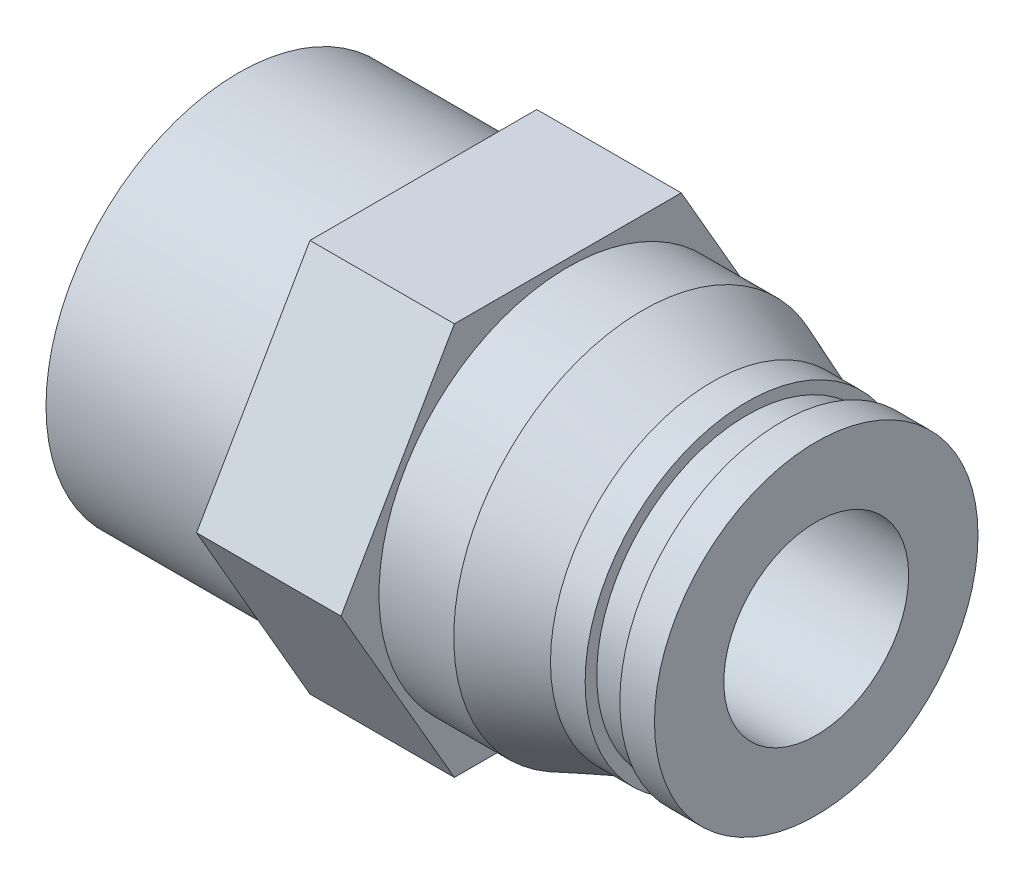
ISO-10303-21;
HEADER;
FILE_DESCRIPTION(('STEP AP214'),'2;1');
FILE_NAME('part.step','',(''),(''),'','','');
FILE_SCHEMA(('AUTOMOTIVE_DESIGN { 1 0 10303 214 1 1 1 1 }'));
ENDSEC;
DATA;
#1=APPLICATION_CONTEXT('core data for automotive mechanical design processes');
#2=APPLICATION_PROTOCOL_DEFINITION('international standard','automotive_design',2000,#1);
#3=PRODUCT_CONTEXT('',#1,'mechanical');
#4=PRODUCT('Part','Part','',(#3));
#5=PRODUCT_RELATED_PRODUCT_CATEGORY('part','',(#4));
#6=PRODUCT_DEFINITION_FORMATION('','',#4);
#7=PRODUCT_DEFINITION_CONTEXT('part definition',#1,'design');
#8=PRODUCT_DEFINITION('design','',#6,#7);
#9=PRODUCT_DEFINITION_SHAPE('','',#8);
#10=(LENGTH_UNIT() NAMED_UNIT(*) SI_UNIT(.MILLI.,.METRE.));
#11=(NAMED_UNIT(*) PLANE_ANGLE_UNIT() SI_UNIT($,.RADIAN.));
#12=(NAMED_UNIT(*) SI_UNIT($,.STERADIAN.) SOLID_ANGLE_UNIT());
#13=UNCERTAINTY_MEASURE_WITH_UNIT(LENGTH_MEASURE(1.E-05),#10,'distance_accuracy_value','');
#14=(GEOMETRIC_REPRESENTATION_CONTEXT(3) GLOBAL_UNCERTAINTY_ASSIGNED_CONTEXT((#13)) GLOBAL_UNIT_ASSIGNED_CONTEXT((#10,
#11,#12)) REPRESENTATION_CONTEXT('',''));
#15=CARTESIAN_POINT('',(0.,0.,0.));
#16=DIRECTION('',(0.,0.,1.));
#17=DIRECTION('',(1.,0.,0.));
#18=AXIS2_PLACEMENT_3D('',#15,#16,#17);
#19=CARTESIAN_POINT('',(8.,8.33,0.));
#20=DIRECTION('',(-1.,0.,0.));
#21=DIRECTION('',(0.,0.,1.));
#22=AXIS2_PLACEMENT_3D('',#19,#20,#21);
#23=PLANE('',#22);
#24=CARTESIAN_POINT('',(8.,0.,0.));
#25=DIRECTION('',(1.,0.,0.));
#26=DIRECTION('',(0.,0.,-1.));
#27=AXIS2_PLACEMENT_3D('',#24,#25,#26);
#28=CIRCLE('',#27,8.33);
#29=CARTESIAN_POINT('',(8.,0.,-8.33));
#30=VERTEX_POINT('',#29);
#31=EDGE_CURVE('E215',#30,#30,#28,.T.);
#32=ORIENTED_EDGE('',*,*,#31,.T.);
#33=EDGE_LOOP('',(#32));
#34=FACE_BOUND('',#33,.T.);
#35=DIRECTION('',(0.,-0.866025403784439,0.5));
#36=VECTOR('',#35,1.);
#37=CARTESIAN_POINT('',(8.,0.,-9.81495457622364));
#38=LINE('',#37,#36);
#39=CARTESIAN_POINT('',(8.,0.,-9.81495457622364));
#40=VERTEX_POINT('',#39);
#41=CARTESIAN_POINT('',(8.,-8.5,-4.90747728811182));
#42=VERTEX_POINT('',#41);
#43=EDGE_CURVE('E121',#40,#42,#38,.T.);
#44=ORIENTED_EDGE('',*,*,#43,.T.);
#45=DIRECTION('',(0.,0.,1.));
#46=VECTOR('',#45,1.);
#47=CARTESIAN_POINT('',(8.,-8.5,-4.90747728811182));
#48=LINE('',#47,#46);
#49=CARTESIAN_POINT('',(8.,-8.5,4.90747728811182));
#50=VERTEX_POINT('',#49);
#51=EDGE_CURVE('E106',#42,#50,#48,.T.);
#52=ORIENTED_EDGE('',*,*,#51,.T.);
#53=DIRECTION('',(0.,0.866025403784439,0.5));
#54=VECTOR('',#53,1.);
#55=CARTESIAN_POINT('',(8.,-8.5,4.90747728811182));
#56=LINE('',#55,#54);
#57=CARTESIAN_POINT('',(8.,0.,9.81495457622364));
#58=VERTEX_POINT('',#57);
#59=EDGE_CURVE('E115',#50,#58,#56,.T.);
#60=ORIENTED_EDGE('',*,*,#59,.T.);
#61=DIRECTION('',(0.,0.866025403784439,-0.5));
#62=VECTOR('',#61,1.);
#63=CARTESIAN_POINT('',(8.,0.,9.81495457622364));
#64=LINE('',#63,#62);
#65=CARTESIAN_POINT('',(8.,8.5,4.90747728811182));
#66=VERTEX_POINT('',#65);
#67=EDGE_CURVE('E30',#58,#66,#64,.T.);
#68=ORIENTED_EDGE('',*,*,#67,.T.);
#69=DIRECTION('',(0.,0.,-1.));
#70=VECTOR('',#69,1.);
#71=CARTESIAN_POINT('',(8.,8.5,4.90747728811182));
#72=LINE('',#71,#70);
#73=CARTESIAN_POINT('',(8.,8.5,-4.90747728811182));
#74=VERTEX_POINT('',#73);
#75=EDGE_CURVE('E125',#66,#74,#72,.T.);
#76=ORIENTED_EDGE('',*,*,#75,.T.);
#77=DIRECTION('',(0.,-0.866025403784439,-0.5));
#78=VECTOR('',#77,1.);
#79=CARTESIAN_POINT('',(8.,8.5,-4.90747728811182));
#80=LINE('',#79,#78);
#81=EDGE_CURVE('E128',#74,#40,#80,.T.);
#82=ORIENTED_EDGE('',*,*,#81,.T.);
#83=EDGE_LOOP('',(#44,#52,#60,#68,#76,#82));
#84=FACE_BOUND('',#83,.T.);
#85=ADVANCED_FACE('F15',(#34,#84),#23,.T.);
#86=CARTESIAN_POINT('',(14.25,10.5,0.));
#87=DIRECTION('',(1.,0.,0.));
#88=DIRECTION('',(0.,0.,-1.));
#89=AXIS2_PLACEMENT_3D('',#86,#87,#88);
#90=PLANE('',#89);
#91=CARTESIAN_POINT('',(14.25,0.,0.));
#92=DIRECTION('',(1.,0.,0.));
#93=DIRECTION('',(0.,0.,-1.));
#94=AXIS2_PLACEMENT_3D('',#91,#92,#93);
#95=CIRCLE('',#94,8.17125407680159);
#96=CARTESIAN_POINT('',(14.25,0.,-8.17125407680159));
#97=VERTEX_POINT('',#96);
#98=EDGE_CURVE('E212',#97,#97,#95,.T.);
#99=ORIENTED_EDGE('',*,*,#98,.F.);
#100=EDGE_LOOP('',(#99));
#101=FACE_BOUND('',#100,.T.);
#102=DIRECTION('',(0.,0.866025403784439,0.5));
#103=VECTOR('',#102,1.);
#104=CARTESIAN_POINT('',(14.25,-8.5,4.90747728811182));
#105=LINE('',#104,#103);
#106=CARTESIAN_POINT('',(14.25,-8.5,4.90747728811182));
#107=VERTEX_POINT('',#106);
#108=CARTESIAN_POINT('',(14.25,0.,9.81495457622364));
#109=VERTEX_POINT('',#108);
#110=EDGE_CURVE('E132',#107,#109,#105,.T.);
#111=ORIENTED_EDGE('',*,*,#110,.F.);
#112=DIRECTION('',(0.,0.,1.));
#113=VECTOR('',#112,1.);
#114=CARTESIAN_POINT('',(14.25,-8.5,-4.90747728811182));
#115=LINE('',#114,#113);
#116=CARTESIAN_POINT('',(14.25,-8.5,-4.90747728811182));
#117=VERTEX_POINT('',#116);
#118=EDGE_CURVE('E38',#117,#107,#115,.T.);
#119=ORIENTED_EDGE('',*,*,#118,.F.);
#120=DIRECTION('',(0.,-0.866025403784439,0.5));
#121=VECTOR('',#120,1.);
#122=CARTESIAN_POINT('',(14.25,0.,-9.81495457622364));
#123=LINE('',#122,#121);
#124=CARTESIAN_POINT('',(14.25,0.,-9.81495457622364));
#125=VERTEX_POINT('',#124);
#126=EDGE_CURVE('E112',#125,#117,#123,.T.);
#127=ORIENTED_EDGE('',*,*,#126,.F.);
#128=DIRECTION('',(0.,-0.866025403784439,-0.5));
#129=VECTOR('',#128,1.);
#130=CARTESIAN_POINT('',(14.25,8.5,-4.90747728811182));
#131=LINE('',#130,#129);
#132=CARTESIAN_POINT('',(14.25,8.5,-4.90747728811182));
#133=VERTEX_POINT('',#132);
#134=EDGE_CURVE('E140',#133,#125,#131,.T.);
#135=ORIENTED_EDGE('',*,*,#134,.F.);
#136=DIRECTION('',(0.,0.,-1.));
#137=VECTOR('',#136,1.);
#138=CARTESIAN_POINT('',(14.25,8.5,4.90747728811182));
#139=LINE('',#138,#137);
#140=CARTESIAN_POINT('',(14.25,8.5,4.90747728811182));
#141=VERTEX_POINT('',#140);
#142=EDGE_CURVE('E137',#141,#133,#139,.T.);
#143=ORIENTED_EDGE('',*,*,#142,.F.);
#144=DIRECTION('',(0.,0.866025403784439,-0.5));
#145=VECTOR('',#144,1.);
#146=CARTESIAN_POINT('',(14.25,0.,9.81495457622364));
#147=LINE('',#146,#145);
#148=EDGE_CURVE('E134',#109,#141,#147,.T.);
#149=ORIENTED_EDGE('',*,*,#148,.F.);
#150=EDGE_LOOP('',(#111,#119,#127,#135,#143,#149));
#151=FACE_BOUND('',#150,.T.);
#152=ADVANCED_FACE('F269',(#101,#151),#90,.T.);
#153=CARTESIAN_POINT('',(0.,0.,0.));
#154=DIRECTION('',(-1.,0.,0.));
#155=DIRECTION('',(0.,0.,1.));
#156=AXIS2_PLACEMENT_3D('',#153,#154,#155);
#157=PLANE('',#156);
#158=CARTESIAN_POINT('',(0.,0.,0.));
#159=DIRECTION('',(1.,0.,0.));
#160=DIRECTION('',(0.,0.,-1.));
#161=AXIS2_PLACEMENT_3D('',#158,#159,#160);
#162=CIRCLE('',#161,8.33);
#163=CARTESIAN_POINT('',(0.,0.,-8.33));
#164=VERTEX_POINT('',#163);
#165=EDGE_CURVE('E218',#164,#164,#162,.T.);
#166=ORIENTED_EDGE('',*,*,#165,.F.);
#167=EDGE_LOOP('',(#166));
#168=FACE_BOUND('',#167,.T.);
#169=DIRECTION('',(0.,-0.866025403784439,-0.5));
#170=VECTOR('',#169,1.);
#171=CARTESIAN_POINT('',(0.,0.,3.46410161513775));
#172=LINE('',#171,#170);
#173=CARTESIAN_POINT('',(0.,0.,3.46410161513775));
#174=VERTEX_POINT('',#173);
#175=CARTESIAN_POINT('',(0.,-3.,1.73205080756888));
#176=VERTEX_POINT('',#175);
#177=EDGE_CURVE('E169',#174,#176,#172,.T.);
#178=ORIENTED_EDGE('',*,*,#177,.T.);
#179=DIRECTION('',(0.,0.,-1.));
#180=VECTOR('',#179,1.);
#181=CARTESIAN_POINT('',(0.,-3.,1.73205080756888));
#182=LINE('',#181,#180);
#183=CARTESIAN_POINT('',(0.,-3.,-1.73205080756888));
#184=VERTEX_POINT('',#183);
#185=EDGE_CURVE('E147',#176,#184,#182,.T.);
#186=ORIENTED_EDGE('',*,*,#185,.T.);
#187=DIRECTION('',(0.,0.866025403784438,-0.5));
#188=VECTOR('',#187,1.);
#189=CARTESIAN_POINT('',(0.,-3.,-1.73205080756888));
#190=LINE('',#189,#188);
#191=CARTESIAN_POINT('',(0.,0.,-3.46410161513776));
#192=VERTEX_POINT('',#191);
#193=EDGE_CURVE('E157',#184,#192,#190,.T.);
#194=ORIENTED_EDGE('',*,*,#193,.T.);
#195=DIRECTION('',(0.,0.866025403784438,0.5));
#196=VECTOR('',#195,1.);
#197=CARTESIAN_POINT('',(0.,0.,-3.46410161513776));
#198=LINE('',#197,#196);
#199=CARTESIAN_POINT('',(0.,3.,-1.73205080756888));
#200=VERTEX_POINT('',#199);
#201=EDGE_CURVE('E160',#192,#200,#198,.T.);
#202=ORIENTED_EDGE('',*,*,#201,.T.);
#203=DIRECTION('',(0.,0.,1.));
#204=VECTOR('',#203,1.);
#205=CARTESIAN_POINT('',(0.,3.,-1.73205080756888));
#206=LINE('',#205,#204);
#207=CARTESIAN_POINT('',(0.,3.,1.73205080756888));
#208=VERTEX_POINT('',#207);
#209=EDGE_CURVE('E163',#200,#208,#206,.T.);
#210=ORIENTED_EDGE('',*,*,#209,.T.);
#211=DIRECTION('',(0.,-0.866025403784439,0.5));
#212=VECTOR('',#211,1.);
#213=CARTESIAN_POINT('',(0.,3.,1.73205080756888));
#214=LINE('',#213,#212);
#215=EDGE_CURVE('E166',#208,#174,#214,.T.);
#216=ORIENTED_EDGE('',*,*,#215,.T.);
#217=EDGE_LOOP('',(#178,#186,#194,#202,#210,#216));
#218=FACE_BOUND('',#217,.T.);
#219=ADVANCED_FACE('F17',(#168,#218),#157,.T.);
#220=CARTESIAN_POINT('',(7.5,4.,0.));
#221=DIRECTION('',(1.,0.,0.));
#222=DIRECTION('',(0.,0.,-1.));
#223=AXIS2_PLACEMENT_3D('',#220,#221,#222);
#224=PLANE('',#223);
#225=CARTESIAN_POINT('',(7.5,0.,0.));
#226=DIRECTION('',(1.,0.,0.));
#227=DIRECTION('',(0.,0.,-1.));
#228=AXIS2_PLACEMENT_3D('',#225,#226,#227);
#229=CIRCLE('',#228,4.);
#230=CARTESIAN_POINT('',(7.5,0.,-4.));
#231=VERTEX_POINT('',#230);
#232=EDGE_CURVE('E185',#231,#231,#229,.T.);
#233=ORIENTED_EDGE('',*,*,#232,.T.);
#234=EDGE_LOOP('',(#233));
#235=FACE_BOUND('',#234,.T.);
#236=DIRECTION('',(0.,-0.866025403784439,0.5));
#237=VECTOR('',#236,1.);
#238=CARTESIAN_POINT('',(7.5,1.5,-4.3301270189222));
#239=LINE('',#238,#237);
#240=CARTESIAN_POINT('',(7.5,0.,-3.46410161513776));
#241=VERTEX_POINT('',#240);
#242=CARTESIAN_POINT('',(7.5,-3.,-1.73205080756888));
#243=VERTEX_POINT('',#242);
#244=EDGE_CURVE('E23',#241,#243,#239,.T.);
#245=ORIENTED_EDGE('',*,*,#244,.T.);
#246=DIRECTION('',(0.,0.,1.));
#247=VECTOR('',#246,1.);
#248=CARTESIAN_POINT('',(7.5,-3.,0.));
#249=LINE('',#248,#247);
#250=CARTESIAN_POINT('',(7.5,-3.,1.73205080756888));
#251=VERTEX_POINT('',#250);
#252=EDGE_CURVE('E9',#243,#251,#249,.T.);
#253=ORIENTED_EDGE('',*,*,#252,.T.);
#254=DIRECTION('',(0.,0.866025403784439,0.5));
#255=VECTOR('',#254,1.);
#256=CARTESIAN_POINT('',(7.5,1.5,4.33012701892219));
#257=LINE('',#256,#255);
#258=CARTESIAN_POINT('',(7.5,0.,3.46410161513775));
#259=VERTEX_POINT('',#258);
#260=EDGE_CURVE('E221',#251,#259,#257,.T.);
#261=ORIENTED_EDGE('',*,*,#260,.T.);
#262=DIRECTION('',(0.,0.866025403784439,-0.5));
#263=VECTOR('',#262,1.);
#264=CARTESIAN_POINT('',(7.5,4.5,0.866025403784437));
#265=LINE('',#264,#263);
#266=CARTESIAN_POINT('',(7.5,3.,1.73205080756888));
#267=VERTEX_POINT('',#266);
#268=EDGE_CURVE('E224',#259,#267,#265,.T.);
#269=ORIENTED_EDGE('',*,*,#268,.T.);
#270=DIRECTION('',(0.,0.,-1.));
#271=VECTOR('',#270,1.);
#272=CARTESIAN_POINT('',(7.5,3.,0.));
#273=LINE('',#272,#271);
#274=CARTESIAN_POINT('',(7.5,3.,-1.73205080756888));
#275=VERTEX_POINT('',#274);
#276=EDGE_CURVE('E227',#267,#275,#273,.T.);
#277=ORIENTED_EDGE('',*,*,#276,.T.);
#278=DIRECTION('',(0.,-0.866025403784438,-0.5));
#279=VECTOR('',#278,1.);
#280=CARTESIAN_POINT('',(7.5,4.5,-0.866025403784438));
#281=LINE('',#280,#279);
#282=EDGE_CURVE('E230',#275,#241,#281,.T.);
#283=ORIENTED_EDGE('',*,*,#282,.T.);
#284=EDGE_LOOP('',(#245,#253,#261,#269,#277,#283));
#285=FACE_BOUND('',#284,.T.);
#286=ADVANCED_FACE('F234',(#235,#285),#224,.T.);
#287=CARTESIAN_POINT('',(0.,0.,0.));
#288=DIRECTION('',(1.,0.,0.));
#289=DIRECTION('',(0.,0.,-1.));
#290=AXIS2_PLACEMENT_3D('',#287,#288,#289);
#291=CYLINDRICAL_SURFACE('',#290,8.33);
#292=ORIENTED_EDGE('',*,*,#165,.T.);
#293=EDGE_LOOP('',(#292));
#294=FACE_BOUND('',#293,.T.);
#295=ORIENTED_EDGE('',*,*,#31,.F.);
#296=EDGE_LOOP('',(#295));
#297=FACE_BOUND('',#296,.T.);
#298=ADVANCED_FACE('F278',(#294,#297),#291,.T.);
#299=CARTESIAN_POINT('',(0.,0.,0.));
#300=DIRECTION('',(1.,0.,0.));
#301=DIRECTION('',(0.,0.,-1.));
#302=AXIS2_PLACEMENT_3D('',#299,#300,#301);
#303=CYLINDRICAL_SURFACE('',#302,8.17125407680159);
#304=ORIENTED_EDGE('',*,*,#98,.T.);
#305=EDGE_LOOP('',(#304));
#306=FACE_BOUND('',#305,.T.);
#307=CARTESIAN_POINT('',(17.4847468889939,0.,0.));
#308=DIRECTION('',(1.,0.,0.));
#309=DIRECTION('',(0.,0.,-1.));
#310=AXIS2_PLACEMENT_3D('',#307,#308,#309);
#311=CIRCLE('',#310,8.17125407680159);
#312=CARTESIAN_POINT('',(17.4847468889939,0.,-8.17125407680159));
#313=VERTEX_POINT('',#312);
#314=EDGE_CURVE('E209',#313,#313,#311,.T.);
#315=ORIENTED_EDGE('',*,*,#314,.F.);
#316=EDGE_LOOP('',(#315));
#317=FACE_BOUND('',#316,.T.);
#318=ADVANCED_FACE('F280',(#306,#317),#303,.T.);
#319=CARTESIAN_POINT('',(20.5,0.,0.));
#320=DIRECTION('',(-1.,0.,0.));
#321=DIRECTION('',(0.,0.,1.));
#322=AXIS2_PLACEMENT_3D('',#319,#320,#321);
#323=CONICAL_SURFACE('',#322,7.,0.370503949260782);
#324=ORIENTED_EDGE('',*,*,#314,.T.);
#325=EDGE_LOOP('',(#324));
#326=FACE_BOUND('',#325,.T.);
#327=CARTESIAN_POINT('',(20.5,0.,0.));
#328=DIRECTION('',(1.,0.,0.));
#329=DIRECTION('',(0.,0.,-1.));
#330=AXIS2_PLACEMENT_3D('',#327,#328,#329);
#331=CIRCLE('',#330,7.);
#332=CARTESIAN_POINT('',(20.5,0.,-7.));
#333=VERTEX_POINT('',#332);
#334=EDGE_CURVE('E206',#333,#333,#331,.T.);
#335=ORIENTED_EDGE('',*,*,#334,.F.);
#336=EDGE_LOOP('',(#335));
#337=FACE_BOUND('',#336,.T.);
#338=ADVANCED_FACE('F286',(#326,#337),#323,.T.);
#339=CARTESIAN_POINT('',(0.,0.,0.));
#340=DIRECTION('',(1.,0.,0.));
#341=DIRECTION('',(0.,0.,-1.));
#342=AXIS2_PLACEMENT_3D('',#339,#340,#341);
#343=CYLINDRICAL_SURFACE('',#342,7.);
#344=ORIENTED_EDGE('',*,*,#334,.T.);
#345=EDGE_LOOP('',(#344));
#346=FACE_BOUND('',#345,.T.);
#347=CARTESIAN_POINT('',(22.,0.,0.));
#348=DIRECTION('',(1.,0.,0.));
#349=DIRECTION('',(0.,0.,-1.));
#350=AXIS2_PLACEMENT_3D('',#347,#348,#349);
#351=CIRCLE('',#350,7.);
#352=CARTESIAN_POINT('',(22.,0.,-7.));
#353=VERTEX_POINT('',#352);
#354=EDGE_CURVE('E203',#353,#353,#351,.T.);
#355=ORIENTED_EDGE('',*,*,#354,.F.);
#356=EDGE_LOOP('',(#355));
#357=FACE_BOUND('',#356,.T.);
#358=ADVANCED_FACE('F330',(#346,#357),#343,.T.);
#359=CARTESIAN_POINT('',(22.,7.,0.));
#360=DIRECTION('',(1.,0.,0.));
#361=DIRECTION('',(0.,0.,-1.));
#362=AXIS2_PLACEMENT_3D('',#359,#360,#361);
#363=PLANE('',#362);
#364=ORIENTED_EDGE('',*,*,#354,.T.);
#365=EDGE_LOOP('',(#364));
#366=FACE_BOUND('',#365,.T.);
#367=CARTESIAN_POINT('',(22.,0.,0.));
#368=DIRECTION('',(1.,0.,0.));
#369=DIRECTION('',(0.,0.,-1.));
#370=AXIS2_PLACEMENT_3D('',#367,#368,#369);
#371=CIRCLE('',#370,6.5);
#372=CARTESIAN_POINT('',(22.,0.,-6.5));
#373=VERTEX_POINT('',#372);
#374=EDGE_CURVE('E200',#373,#373,#371,.T.);
#375=ORIENTED_EDGE('',*,*,#374,.F.);
#376=EDGE_LOOP('',(#375));
#377=FACE_BOUND('',#376,.T.);
#378=ADVANCED_FACE('F340',(#366,#377),#363,.T.);
#379=CARTESIAN_POINT('',(0.,0.,0.));
#380=DIRECTION('',(1.,0.,0.));
#381=DIRECTION('',(0.,0.,-1.));
#382=AXIS2_PLACEMENT_3D('',#379,#380,#381);
#383=CYLINDRICAL_SURFACE('',#382,6.5);
#384=ORIENTED_EDGE('',*,*,#374,.T.);
#385=EDGE_LOOP('',(#384));
#386=FACE_BOUND('',#385,.T.);
#387=CARTESIAN_POINT('',(23.5,0.,0.));
#388=DIRECTION('',(1.,0.,0.));
#389=DIRECTION('',(0.,0.,-1.));
#390=AXIS2_PLACEMENT_3D('',#387,#388,#389);
#391=CIRCLE('',#390,6.5);
#392=CARTESIAN_POINT('',(23.5,0.,-6.5));
#393=VERTEX_POINT('',#392);
#394=EDGE_CURVE('E197',#393,#393,#391,.T.);
#395=ORIENTED_EDGE('',*,*,#394,.F.);
#396=EDGE_LOOP('',(#395));
#397=FACE_BOUND('',#396,.T.);
#398=ADVANCED_FACE('F350',(#386,#397),#383,.T.);
#399=CARTESIAN_POINT('',(23.5,6.5,0.));
#400=DIRECTION('',(-1.,0.,0.));
#401=DIRECTION('',(0.,0.,1.));
#402=AXIS2_PLACEMENT_3D('',#399,#400,#401);
#403=PLANE('',#402);
#404=ORIENTED_EDGE('',*,*,#394,.T.);
#405=EDGE_LOOP('',(#404));
#406=FACE_BOUND('',#405,.T.);
#407=CARTESIAN_POINT('',(23.5,0.,0.));
#408=DIRECTION('',(1.,0.,0.));
#409=DIRECTION('',(0.,0.,-1.));
#410=AXIS2_PLACEMENT_3D('',#407,#408,#409);
#411=CIRCLE('',#410,7.);
#412=CARTESIAN_POINT('',(23.5,0.,-7.));
#413=VERTEX_POINT('',#412);
#414=EDGE_CURVE('E194',#413,#413,#411,.T.);
#415=ORIENTED_EDGE('',*,*,#414,.F.);
#416=EDGE_LOOP('',(#415));
#417=FACE_BOUND('',#416,.T.);
#418=ADVANCED_FACE('F361',(#406,#417),#403,.T.);
#419=CARTESIAN_POINT('',(0.,0.,0.));
#420=DIRECTION('',(1.,0.,0.));
#421=DIRECTION('',(0.,0.,-1.));
#422=AXIS2_PLACEMENT_3D('',#419,#420,#421);
#423=CYLINDRICAL_SURFACE('',#422,7.);
#424=ORIENTED_EDGE('',*,*,#414,.T.);
#425=EDGE_LOOP('',(#424));
#426=FACE_BOUND('',#425,.T.);
#427=CARTESIAN_POINT('',(25.,0.,0.));
#428=DIRECTION('',(1.,0.,0.));
#429=DIRECTION('',(0.,0.,-1.));
#430=AXIS2_PLACEMENT_3D('',#427,#428,#429);
#431=CIRCLE('',#430,7.);
#432=CARTESIAN_POINT('',(25.,0.,-7.));
#433=VERTEX_POINT('',#432);
#434=EDGE_CURVE('E191',#433,#433,#431,.T.);
#435=ORIENTED_EDGE('',*,*,#434,.F.);
#436=EDGE_LOOP('',(#435));
#437=FACE_BOUND('',#436,.T.);
#438=ADVANCED_FACE('F375',(#426,#437),#423,.T.);
#439=CARTESIAN_POINT('',(25.,7.,0.));
#440=DIRECTION('',(1.,0.,0.));
#441=DIRECTION('',(0.,0.,-1.));
#442=AXIS2_PLACEMENT_3D('',#439,#440,#441);
#443=PLANE('',#442);
#444=ORIENTED_EDGE('',*,*,#434,.T.);
#445=EDGE_LOOP('',(#444));
#446=FACE_BOUND('',#445,.T.);
#447=CARTESIAN_POINT('',(25.,0.,0.));
#448=DIRECTION('',(1.,0.,0.));
#449=DIRECTION('',(0.,0.,-1.));
#450=AXIS2_PLACEMENT_3D('',#447,#448,#449);
#451=CIRCLE('',#450,4.);
#452=CARTESIAN_POINT('',(25.,0.,-4.));
#453=VERTEX_POINT('',#452);
#454=EDGE_CURVE('E188',#453,#453,#451,.T.);
#455=ORIENTED_EDGE('',*,*,#454,.F.);
#456=EDGE_LOOP('',(#455));
#457=FACE_BOUND('',#456,.T.);
#458=ADVANCED_FACE('F385',(#446,#457),#443,.T.);
#459=CARTESIAN_POINT('',(0.,0.,0.));
#460=DIRECTION('',(1.,0.,0.));
#461=DIRECTION('',(0.,0.,-1.));
#462=AXIS2_PLACEMENT_3D('',#459,#460,#461);
#463=CYLINDRICAL_SURFACE('',#462,4.);
#464=ORIENTED_EDGE('',*,*,#454,.T.);
#465=EDGE_LOOP('',(#464));
#466=FACE_BOUND('',#465,.T.);
#467=ORIENTED_EDGE('',*,*,#232,.F.);
#468=EDGE_LOOP('',(#467));
#469=FACE_BOUND('',#468,.T.);
#470=ADVANCED_FACE('F396',(#466,#469),#463,.F.);
#471=CARTESIAN_POINT('',(25.,-3.,1.73205080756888));
#472=DIRECTION('',(0.,1.,0.));
#473=DIRECTION('',(0.,0.,1.));
#474=AXIS2_PLACEMENT_3D('',#471,#472,#473);
#475=PLANE('',#474);
#476=DIRECTION('',(-1.,0.,0.));
#477=VECTOR('',#476,1.);
#478=CARTESIAN_POINT('',(25.,-3.,-1.73205080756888));
#479=LINE('',#478,#477);
#480=EDGE_CURVE('E183',#243,#184,#479,.T.);
#481=ORIENTED_EDGE('',*,*,#480,.T.);
#482=ORIENTED_EDGE('',*,*,#185,.F.);
#483=DIRECTION('',(-1.,0.,0.));
#484=VECTOR('',#483,1.);
#485=CARTESIAN_POINT('',(25.,-3.,1.73205080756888));
#486=LINE('',#485,#484);
#487=EDGE_CURVE('E172',#251,#176,#486,.T.);
#488=ORIENTED_EDGE('',*,*,#487,.F.);
#489=ORIENTED_EDGE('',*,*,#252,.F.);
#490=EDGE_LOOP('',(#481,#482,#488,#489));
#491=FACE_BOUND('',#490,.T.);
#492=ADVANCED_FACE('F249',(#491),#475,.T.);
#493=CARTESIAN_POINT('',(25.,-3.,-1.73205080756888));
#494=DIRECTION('',(0.,0.5,0.866025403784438));
#495=DIRECTION('',(0.,-0.866025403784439,0.5));
#496=AXIS2_PLACEMENT_3D('',#493,#494,#495);
#497=PLANE('',#496);
#498=DIRECTION('',(-1.,0.,0.));
#499=VECTOR('',#498,1.);
#500=CARTESIAN_POINT('',(25.,0.,-3.46410161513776));
#501=LINE('',#500,#499);
#502=EDGE_CURVE('E181',#241,#192,#501,.T.);
#503=ORIENTED_EDGE('',*,*,#502,.T.);
#504=ORIENTED_EDGE('',*,*,#193,.F.);
#505=ORIENTED_EDGE('',*,*,#480,.F.);
#506=ORIENTED_EDGE('',*,*,#244,.F.);
#507=EDGE_LOOP('',(#503,#504,#505,#506));
#508=FACE_BOUND('',#507,.T.);
#509=ADVANCED_FACE('F238',(#508),#497,.T.);
#510=CARTESIAN_POINT('',(25.,0.,-3.46410161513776));
#511=DIRECTION('',(0.,-0.5,0.866025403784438));
#512=DIRECTION('',(0.,-0.866025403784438,-0.5));
#513=AXIS2_PLACEMENT_3D('',#510,#511,#512);
#514=PLANE('',#513);
#515=DIRECTION('',(-1.,0.,0.));
#516=VECTOR('',#515,1.);
#517=CARTESIAN_POINT('',(25.,3.,-1.73205080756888));
#518=LINE('',#517,#516);
#519=EDGE_CURVE('E179',#275,#200,#518,.T.);
#520=ORIENTED_EDGE('',*,*,#519,.T.);
#521=ORIENTED_EDGE('',*,*,#201,.F.);
#522=ORIENTED_EDGE('',*,*,#502,.F.);
#523=ORIENTED_EDGE('',*,*,#282,.F.);
#524=EDGE_LOOP('',(#520,#521,#522,#523));
#525=FACE_BOUND('',#524,.T.);
#526=ADVANCED_FACE('F242',(#525),#514,.T.);
#527=CARTESIAN_POINT('',(25.,3.,-1.73205080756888));
#528=DIRECTION('',(0.,-1.,0.));
#529=DIRECTION('',(0.,0.,-1.));
#530=AXIS2_PLACEMENT_3D('',#527,#528,#529);
#531=PLANE('',#530);
#532=DIRECTION('',(-1.,0.,0.));
#533=VECTOR('',#532,1.);
#534=CARTESIAN_POINT('',(25.,3.,1.73205080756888));
#535=LINE('',#534,#533);
#536=EDGE_CURVE('E177',#267,#208,#535,.T.);
#537=ORIENTED_EDGE('',*,*,#536,.T.);
#538=ORIENTED_EDGE('',*,*,#209,.F.);
#539=ORIENTED_EDGE('',*,*,#519,.F.);
#540=ORIENTED_EDGE('',*,*,#276,.F.);
#541=EDGE_LOOP('',(#537,#538,#539,#540));
#542=FACE_BOUND('',#541,.T.);
#543=ADVANCED_FACE('F258',(#542),#531,.T.);
#544=CARTESIAN_POINT('',(25.,3.,1.73205080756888));
#545=DIRECTION('',(0.,-0.5,-0.866025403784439));
#546=DIRECTION('',(0.,0.866025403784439,-0.5));
#547=AXIS2_PLACEMENT_3D('',#544,#545,#546);
#548=PLANE('',#547);
#549=DIRECTION('',(-1.,0.,0.));
#550=VECTOR('',#549,1.);
#551=CARTESIAN_POINT('',(25.,0.,3.46410161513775));
#552=LINE('',#551,#550);
#553=EDGE_CURVE('E175',#259,#174,#552,.T.);
#554=ORIENTED_EDGE('',*,*,#553,.T.);
#555=ORIENTED_EDGE('',*,*,#215,.F.);
#556=ORIENTED_EDGE('',*,*,#536,.F.);
#557=ORIENTED_EDGE('',*,*,#268,.F.);
#558=EDGE_LOOP('',(#554,#555,#556,#557));
#559=FACE_BOUND('',#558,.T.);
#560=ADVANCED_FACE('F255',(#559),#548,.T.);
#561=CARTESIAN_POINT('',(25.,0.,3.46410161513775));
#562=DIRECTION('',(0.,0.5,-0.866025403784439));
#563=DIRECTION('',(0.,0.866025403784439,0.5));
#564=AXIS2_PLACEMENT_3D('',#561,#562,#563);
#565=PLANE('',#564);
#566=ORIENTED_EDGE('',*,*,#487,.T.);
#567=ORIENTED_EDGE('',*,*,#177,.F.);
#568=ORIENTED_EDGE('',*,*,#553,.F.);
#569=ORIENTED_EDGE('',*,*,#260,.F.);
#570=EDGE_LOOP('',(#566,#567,#568,#569));
#571=FACE_BOUND('',#570,.T.);
#572=ADVANCED_FACE('F251',(#571),#565,.T.);
#573=CARTESIAN_POINT('',(14.25,-8.5,-4.90747728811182));
#574=DIRECTION('',(0.,-1.,0.));
#575=DIRECTION('',(0.,0.,-1.));
#576=AXIS2_PLACEMENT_3D('',#573,#574,#575);
#577=PLANE('',#576);
#578=DIRECTION('',(-1.,0.,0.));
#579=VECTOR('',#578,1.);
#580=CARTESIAN_POINT('',(14.25,-8.5,-4.90747728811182));
#581=LINE('',#580,#579);
#582=EDGE_CURVE('E145',#117,#42,#581,.T.);
#583=ORIENTED_EDGE('',*,*,#582,.F.);
#584=ORIENTED_EDGE('',*,*,#118,.T.);
#585=DIRECTION('',(-1.,0.,0.));
#586=VECTOR('',#585,1.);
#587=CARTESIAN_POINT('',(14.25,-8.5,4.90747728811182));
#588=LINE('',#587,#586);
#589=EDGE_CURVE('E102',#107,#50,#588,.T.);
#590=ORIENTED_EDGE('',*,*,#589,.T.);
#591=ORIENTED_EDGE('',*,*,#51,.F.);
#592=EDGE_LOOP('',(#583,#584,#590,#591));
#593=FACE_BOUND('',#592,.T.);
#594=ADVANCED_FACE('F104',(#593),#577,.T.);
#595=CARTESIAN_POINT('',(14.25,0.,-9.81495457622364));
#596=DIRECTION('',(0.,-0.5,-0.866025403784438));
#597=DIRECTION('',(0.,0.866025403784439,-0.5));
#598=AXIS2_PLACEMENT_3D('',#595,#596,#597);
#599=PLANE('',#598);
#600=DIRECTION('',(-1.,0.,0.));
#601=VECTOR('',#600,1.);
#602=CARTESIAN_POINT('',(14.25,0.,-9.81495457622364));
#603=LINE('',#602,#601);
#604=EDGE_CURVE('E148',#125,#40,#603,.T.);
#605=ORIENTED_EDGE('',*,*,#604,.F.);
#606=ORIENTED_EDGE('',*,*,#126,.T.);
#607=ORIENTED_EDGE('',*,*,#582,.T.);
#608=ORIENTED_EDGE('',*,*,#43,.F.);
#609=EDGE_LOOP('',(#605,#606,#607,#608));
#610=FACE_BOUND('',#609,.T.);
#611=ADVANCED_FACE('F457',(#610),#599,.T.);
#612=CARTESIAN_POINT('',(14.25,8.5,-4.90747728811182));
#613=DIRECTION('',(0.,0.5,-0.866025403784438));
#614=DIRECTION('',(0.,0.866025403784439,0.5));
#615=AXIS2_PLACEMENT_3D('',#612,#613,#614);
#616=PLANE('',#615);
#617=DIRECTION('',(-1.,0.,0.));
#618=VECTOR('',#617,1.);
#619=CARTESIAN_POINT('',(14.25,8.5,-4.90747728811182));
#620=LINE('',#619,#618);
#621=EDGE_CURVE('E150',#133,#74,#620,.T.);
#622=ORIENTED_EDGE('',*,*,#621,.F.);
#623=ORIENTED_EDGE('',*,*,#134,.T.);
#624=ORIENTED_EDGE('',*,*,#604,.T.);
#625=ORIENTED_EDGE('',*,*,#81,.F.);
#626=EDGE_LOOP('',(#622,#623,#624,#625));
#627=FACE_BOUND('',#626,.T.);
#628=ADVANCED_FACE('F466',(#627),#616,.T.);
#629=CARTESIAN_POINT('',(14.25,8.5,4.90747728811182));
#630=DIRECTION('',(0.,1.,0.));
#631=DIRECTION('',(0.,0.,1.));
#632=AXIS2_PLACEMENT_3D('',#629,#630,#631);
#633=PLANE('',#632);
#634=DIRECTION('',(-1.,0.,0.));
#635=VECTOR('',#634,1.);
#636=CARTESIAN_POINT('',(14.25,8.5,4.90747728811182));
#637=LINE('',#636,#635);
#638=EDGE_CURVE('E152',#141,#66,#637,.T.);
#639=ORIENTED_EDGE('',*,*,#638,.F.);
#640=ORIENTED_EDGE('',*,*,#142,.T.);
#641=ORIENTED_EDGE('',*,*,#621,.T.);
#642=ORIENTED_EDGE('',*,*,#75,.F.);
#643=EDGE_LOOP('',(#639,#640,#641,#642));
#644=FACE_BOUND('',#643,.T.);
#645=ADVANCED_FACE('F476',(#644),#633,.T.);
#646=CARTESIAN_POINT('',(14.25,0.,9.81495457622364));
#647=DIRECTION('',(0.,0.5,0.866025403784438));
#648=DIRECTION('',(0.,-0.866025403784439,0.5));
#649=AXIS2_PLACEMENT_3D('',#646,#647,#648);
#650=PLANE('',#649);
#651=DIRECTION('',(-1.,0.,0.));
#652=VECTOR('',#651,1.);
#653=CARTESIAN_POINT('',(14.25,0.,9.81495457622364));
#654=LINE('',#653,#652);
#655=EDGE_CURVE('E111',#109,#58,#654,.T.);
#656=ORIENTED_EDGE('',*,*,#655,.F.);
#657=ORIENTED_EDGE('',*,*,#148,.T.);
#658=ORIENTED_EDGE('',*,*,#638,.T.);
#659=ORIENTED_EDGE('',*,*,#67,.F.);
#660=EDGE_LOOP('',(#656,#657,#658,#659));
#661=FACE_BOUND('',#660,.T.);
#662=ADVANCED_FACE('F486',(#661),#650,.T.);
#663=CARTESIAN_POINT('',(14.25,-8.5,4.90747728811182));
#664=DIRECTION('',(0.,-0.5,0.866025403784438));
#665=DIRECTION('',(0.,-0.866025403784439,-0.5));
#666=AXIS2_PLACEMENT_3D('',#663,#664,#665);
#667=PLANE('',#666);
#668=ORIENTED_EDGE('',*,*,#589,.F.);
#669=ORIENTED_EDGE('',*,*,#110,.T.);
#670=ORIENTED_EDGE('',*,*,#655,.T.);
#671=ORIENTED_EDGE('',*,*,#59,.F.);
#672=EDGE_LOOP('',(#668,#669,#670,#671));
#673=FACE_BOUND('',#672,.T.);
#674=ADVANCED_FACE('F116',(#673),#667,.T.);
#675=CLOSED_SHELL('',(#85,#152,#219,#286,#298,#318,#338,#358,#378,#398,#418,#438,#458,#470,#492,
#509,#526,#543,#560,#572,#594,#611,#628,#645,#662,#674));
#676=MANIFOLD_SOLID_BREP('B1',#675);
#677=ADVANCED_BREP_SHAPE_REPRESENTATION('',(#18,#676),#14);
#678=SHAPE_DEFINITION_REPRESENTATION(#9,#677);
ENDSEC;
END-ISO-10303-21;
